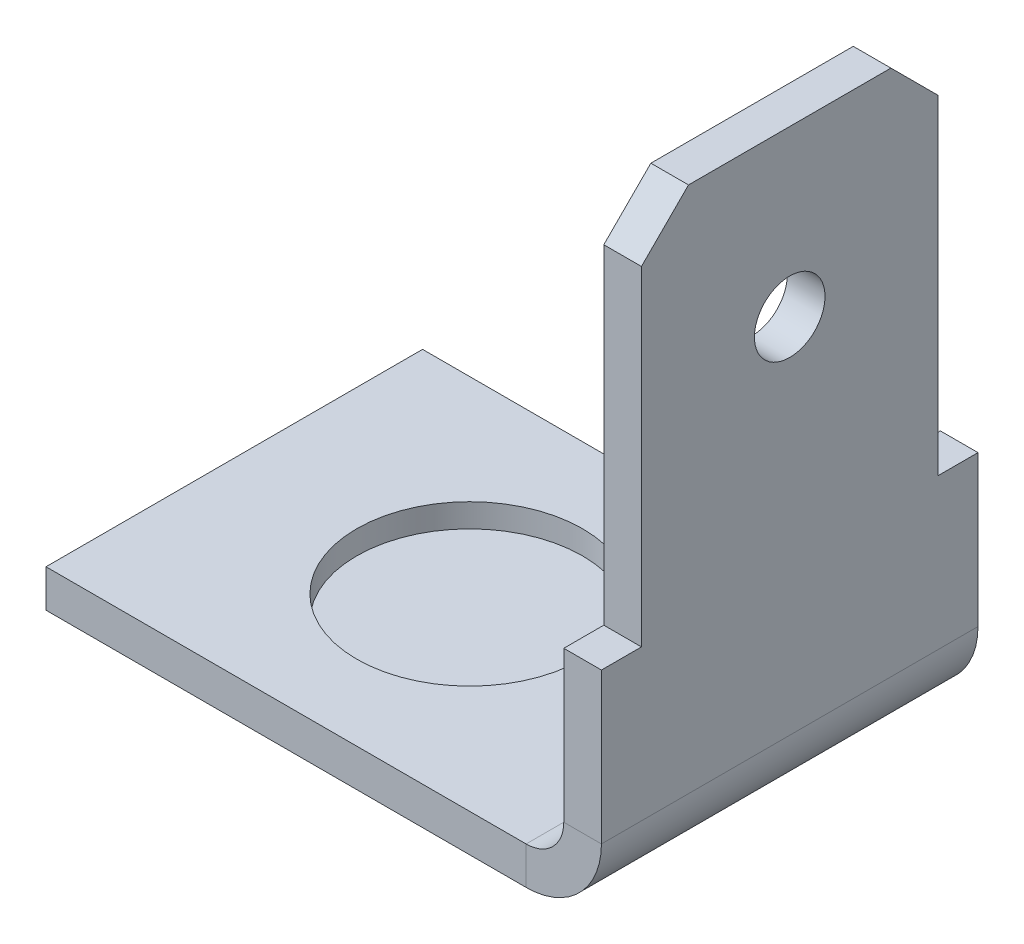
ISO-10303-21;
HEADER;
FILE_DESCRIPTION(('STEP AP214'),'2;1');
FILE_NAME('part.step','',(''),(''),'','','');
FILE_SCHEMA(('AUTOMOTIVE_DESIGN { 1 0 10303 214 1 1 1 1 }'));
ENDSEC;
DATA;
#1=APPLICATION_CONTEXT('core data for automotive mechanical design processes');
#2=APPLICATION_PROTOCOL_DEFINITION('international standard','automotive_design',2000,#1);
#3=PRODUCT_CONTEXT('',#1,'mechanical');
#4=PRODUCT('Part','Part','',(#3));
#5=PRODUCT_RELATED_PRODUCT_CATEGORY('part','',(#4));
#6=PRODUCT_DEFINITION_FORMATION('','',#4);
#7=PRODUCT_DEFINITION_CONTEXT('part definition',#1,'design');
#8=PRODUCT_DEFINITION('design','',#6,#7);
#9=PRODUCT_DEFINITION_SHAPE('','',#8);
#10=(LENGTH_UNIT() NAMED_UNIT(*) SI_UNIT(.MILLI.,.METRE.));
#11=(NAMED_UNIT(*) PLANE_ANGLE_UNIT() SI_UNIT($,.RADIAN.));
#12=(NAMED_UNIT(*) SI_UNIT($,.STERADIAN.) SOLID_ANGLE_UNIT());
#13=UNCERTAINTY_MEASURE_WITH_UNIT(LENGTH_MEASURE(1.E-05),#10,'distance_accuracy_value','');
#14=(GEOMETRIC_REPRESENTATION_CONTEXT(3) GLOBAL_UNCERTAINTY_ASSIGNED_CONTEXT((#13)) GLOBAL_UNIT_ASSIGNED_CONTEXT((#10,
#11,#12)) REPRESENTATION_CONTEXT('',''));
#15=CARTESIAN_POINT('',(0.,0.,0.));
#16=DIRECTION('',(0.,0.,1.));
#17=DIRECTION('',(1.,0.,0.));
#18=AXIS2_PLACEMENT_3D('',#15,#16,#17);
#19=CARTESIAN_POINT('',(0.,-0.8,4.));
#20=DIRECTION('',(0.,1.,0.));
#21=DIRECTION('',(0.,0.,1.));
#22=AXIS2_PLACEMENT_3D('',#19,#20,#21);
#23=PLANE('',#22);
#24=DIRECTION('',(0.,0.,-1.));
#25=VECTOR('',#24,1.);
#26=CARTESIAN_POINT('',(0.,-0.8,4.));
#27=LINE('',#26,#25);
#28=CARTESIAN_POINT('',(0.,-0.8,4.));
#29=VERTEX_POINT('',#28);
#30=CARTESIAN_POINT('',(0.,-0.8,-4.));
#31=VERTEX_POINT('',#30);
#32=EDGE_CURVE('E232',#29,#31,#27,.T.);
#33=ORIENTED_EDGE('',*,*,#32,.T.);
#34=DIRECTION('',(1.,0.,0.));
#35=VECTOR('',#34,1.);
#36=CARTESIAN_POINT('',(0.,-0.8,-4.));
#37=LINE('',#36,#35);
#38=CARTESIAN_POINT('',(10.2,-0.8,-4.));
#39=VERTEX_POINT('',#38);
#40=EDGE_CURVE('E199',#31,#39,#37,.T.);
#41=ORIENTED_EDGE('',*,*,#40,.T.);
#42=DIRECTION('',(0.,0.,-1.));
#43=VECTOR('',#42,1.);
#44=CARTESIAN_POINT('',(10.2,-0.8,4.));
#45=LINE('',#44,#43);
#46=CARTESIAN_POINT('',(10.2,-0.8,4.));
#47=VERTEX_POINT('',#46);
#48=EDGE_CURVE('E229',#47,#39,#45,.T.);
#49=ORIENTED_EDGE('',*,*,#48,.F.);
#50=DIRECTION('',(1.,0.,0.));
#51=VECTOR('',#50,1.);
#52=CARTESIAN_POINT('',(0.,-0.8,4.));
#53=LINE('',#52,#51);
#54=EDGE_CURVE('E220',#29,#47,#53,.T.);
#55=ORIENTED_EDGE('',*,*,#54,.F.);
#56=EDGE_LOOP('',(#33,#41,#49,#55));
#57=FACE_BOUND('',#56,.T.);
#58=CARTESIAN_POINT('',(5.,-0.8,0.));
#59=DIRECTION('',(0.,1.,0.));
#60=DIRECTION('',(0.,0.,1.));
#61=AXIS2_PLACEMENT_3D('',#58,#59,#60);
#62=CIRCLE('',#61,0.500000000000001);
#63=CARTESIAN_POINT('',(5.,-0.8,0.500000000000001));
#64=VERTEX_POINT('',#63);
#65=EDGE_CURVE('E11',#64,#64,#62,.F.);
#66=ORIENTED_EDGE('',*,*,#65,.F.);
#67=EDGE_LOOP('',(#66));
#68=FACE_BOUND('',#67,.T.);
#69=ADVANCED_FACE('F34',(#57,#68),#23,.F.);
#70=CARTESIAN_POINT('',(11.,0.800000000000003,4.));
#71=DIRECTION('',(0.,0.,1.));
#72=DIRECTION('',(1.,0.,0.));
#73=AXIS2_PLACEMENT_3D('',#70,#71,#72);
#74=PLANE('',#73);
#75=DIRECTION('',(1.,0.,0.));
#76=VECTOR('',#75,1.);
#77=CARTESIAN_POINT('',(11.,0.800000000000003,4.));
#78=LINE('',#77,#76);
#79=CARTESIAN_POINT('',(11.,0.800000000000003,4.));
#80=VERTEX_POINT('',#79);
#81=CARTESIAN_POINT('',(11.8,0.800000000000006,4.));
#82=VERTEX_POINT('',#81);
#83=EDGE_CURVE('E253',#80,#82,#78,.T.);
#84=ORIENTED_EDGE('',*,*,#83,.F.);
#85=CARTESIAN_POINT('',(10.2,0.8,4.));
#86=DIRECTION('',(0.,0.,-1.));
#87=DIRECTION('',(-1.,0.,0.));
#88=AXIS2_PLACEMENT_3D('',#85,#86,#87);
#89=CIRCLE('',#88,0.8);
#90=CARTESIAN_POINT('',(10.2,0.,4.));
#91=VERTEX_POINT('',#90);
#92=EDGE_CURVE('E211',#91,#80,#89,.F.);
#93=ORIENTED_EDGE('',*,*,#92,.F.);
#94=DIRECTION('',(0.,1.,0.));
#95=VECTOR('',#94,1.);
#96=CARTESIAN_POINT('',(10.2,-0.8,4.));
#97=LINE('',#96,#95);
#98=EDGE_CURVE('E251',#47,#91,#97,.T.);
#99=ORIENTED_EDGE('',*,*,#98,.F.);
#100=CARTESIAN_POINT('',(10.2,0.8,4.));
#101=DIRECTION('',(0.,0.,1.));
#102=DIRECTION('',(1.,0.,0.));
#103=AXIS2_PLACEMENT_3D('',#100,#101,#102);
#104=CIRCLE('',#103,1.6);
#105=EDGE_CURVE('E223',#47,#82,#104,.T.);
#106=ORIENTED_EDGE('',*,*,#105,.T.);
#107=EDGE_LOOP('',(#84,#93,#99,#106));
#108=FACE_BOUND('',#107,.T.);
#109=ADVANCED_FACE('F302',(#108),#74,.T.);
#110=CARTESIAN_POINT('',(10.2,-0.8,4.));
#111=DIRECTION('',(0.,0.,1.));
#112=DIRECTION('',(1.,0.,0.));
#113=AXIS2_PLACEMENT_3D('',#110,#111,#112);
#114=PLANE('',#113);
#115=DIRECTION('',(-1.,0.,0.));
#116=VECTOR('',#115,1.);
#117=CARTESIAN_POINT('',(21.,4.00000000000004,4.));
#118=LINE('',#117,#116);
#119=CARTESIAN_POINT('',(11.8,4.,4.));
#120=VERTEX_POINT('',#119);
#121=CARTESIAN_POINT('',(11.,4.,4.));
#122=VERTEX_POINT('',#121);
#123=EDGE_CURVE('E175',#120,#122,#118,.T.);
#124=ORIENTED_EDGE('',*,*,#123,.T.);
#125=DIRECTION('',(0.,1.,0.));
#126=VECTOR('',#125,1.);
#127=CARTESIAN_POINT('',(11.,0.,4.));
#128=LINE('',#127,#126);
#129=EDGE_CURVE('E208',#80,#122,#128,.T.);
#130=ORIENTED_EDGE('',*,*,#129,.F.);
#131=ORIENTED_EDGE('',*,*,#83,.T.);
#132=DIRECTION('',(0.,1.,0.));
#133=VECTOR('',#132,1.);
#134=CARTESIAN_POINT('',(11.8,0.,4.));
#135=LINE('',#134,#133);
#136=EDGE_CURVE('E205',#82,#120,#135,.T.);
#137=ORIENTED_EDGE('',*,*,#136,.T.);
#138=EDGE_LOOP('',(#124,#130,#131,#137));
#139=FACE_BOUND('',#138,.T.);
#140=ADVANCED_FACE('F282',(#139),#114,.T.);
#141=CARTESIAN_POINT('',(10.2,0.,-4.));
#142=DIRECTION('',(0.,0.,-1.));
#143=DIRECTION('',(-1.,0.,0.));
#144=AXIS2_PLACEMENT_3D('',#141,#142,#143);
#145=PLANE('',#144);
#146=DIRECTION('',(0.,-1.,0.));
#147=VECTOR('',#146,1.);
#148=CARTESIAN_POINT('',(10.2,0.,-4.));
#149=LINE('',#148,#147);
#150=CARTESIAN_POINT('',(10.2,0.,-4.));
#151=VERTEX_POINT('',#150);
#152=EDGE_CURVE('E249',#151,#39,#149,.T.);
#153=ORIENTED_EDGE('',*,*,#152,.F.);
#154=CARTESIAN_POINT('',(10.2,0.8,-4.));
#155=DIRECTION('',(0.,0.,-1.));
#156=DIRECTION('',(-1.,0.,0.));
#157=AXIS2_PLACEMENT_3D('',#154,#155,#156);
#158=CIRCLE('',#157,0.8);
#159=CARTESIAN_POINT('',(11.,0.800000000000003,-4.));
#160=VERTEX_POINT('',#159);
#161=EDGE_CURVE('E190',#151,#160,#158,.F.);
#162=ORIENTED_EDGE('',*,*,#161,.T.);
#163=DIRECTION('',(-1.,0.,0.));
#164=VECTOR('',#163,1.);
#165=CARTESIAN_POINT('',(11.8,0.800000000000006,-4.));
#166=LINE('',#165,#164);
#167=CARTESIAN_POINT('',(11.8,0.800000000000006,-4.));
#168=VERTEX_POINT('',#167);
#169=EDGE_CURVE('E247',#168,#160,#166,.T.);
#170=ORIENTED_EDGE('',*,*,#169,.F.);
#171=CARTESIAN_POINT('',(10.2,0.8,-4.));
#172=DIRECTION('',(0.,0.,1.));
#173=DIRECTION('',(1.,0.,0.));
#174=AXIS2_PLACEMENT_3D('',#171,#172,#173);
#175=CIRCLE('',#174,1.6);
#176=EDGE_CURVE('E202',#39,#168,#175,.T.);
#177=ORIENTED_EDGE('',*,*,#176,.F.);
#178=EDGE_LOOP('',(#153,#162,#170,#177));
#179=FACE_BOUND('',#178,.T.);
#180=ADVANCED_FACE('F295',(#179),#145,.T.);
#181=CARTESIAN_POINT('',(11.8,0.800000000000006,-4.));
#182=DIRECTION('',(0.,0.,-1.));
#183=DIRECTION('',(-1.,0.,0.));
#184=AXIS2_PLACEMENT_3D('',#181,#182,#183);
#185=PLANE('',#184);
#186=DIRECTION('',(1.,0.,0.));
#187=VECTOR('',#186,1.);
#188=CARTESIAN_POINT('',(0.,0.,-4.));
#189=LINE('',#188,#187);
#190=CARTESIAN_POINT('',(0.,0.,-4.));
#191=VERTEX_POINT('',#190);
#192=EDGE_CURVE('E193',#191,#151,#189,.T.);
#193=ORIENTED_EDGE('',*,*,#192,.T.);
#194=ORIENTED_EDGE('',*,*,#152,.T.);
#195=ORIENTED_EDGE('',*,*,#40,.F.);
#196=DIRECTION('',(0.,1.,0.));
#197=VECTOR('',#196,1.);
#198=CARTESIAN_POINT('',(0.,-0.8,-4.));
#199=LINE('',#198,#197);
#200=EDGE_CURVE('E196',#31,#191,#199,.T.);
#201=ORIENTED_EDGE('',*,*,#200,.T.);
#202=EDGE_LOOP('',(#193,#194,#195,#201));
#203=FACE_BOUND('',#202,.T.);
#204=ADVANCED_FACE('F318',(#203),#185,.T.);
#205=CARTESIAN_POINT('',(11.8,0.,4.));
#206=DIRECTION('',(-1.,0.,0.));
#207=DIRECTION('',(0.,-1.,0.));
#208=AXIS2_PLACEMENT_3D('',#205,#206,#207);
#209=PLANE('',#208);
#210=CARTESIAN_POINT('',(11.8,8.5,0.));
#211=DIRECTION('',(-1.,0.,0.));
#212=DIRECTION('',(0.,-1.,0.));
#213=AXIS2_PLACEMENT_3D('',#210,#211,#212);
#214=CIRCLE('',#213,0.75);
#215=CARTESIAN_POINT('',(11.8,7.75,0.));
#216=VERTEX_POINT('',#215);
#217=EDGE_CURVE('E167',#216,#216,#214,.T.);
#218=ORIENTED_EDGE('',*,*,#217,.T.);
#219=EDGE_LOOP('',(#218));
#220=FACE_BOUND('',#219,.T.);
#221=DIRECTION('',(0.,1.,0.));
#222=VECTOR('',#221,1.);
#223=CARTESIAN_POINT('',(11.8,0.,-3.15));
#224=LINE('',#223,#222);
#225=CARTESIAN_POINT('',(11.8,4.,-3.15));
#226=VERTEX_POINT('',#225);
#227=CARTESIAN_POINT('',(11.8,11.,-3.15));
#228=VERTEX_POINT('',#227);
#229=EDGE_CURVE('E140',#226,#228,#224,.T.);
#230=ORIENTED_EDGE('',*,*,#229,.T.);
#231=DIRECTION('',(0.,0.707106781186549,0.707106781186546));
#232=VECTOR('',#231,1.);
#233=CARTESIAN_POINT('',(11.8,12.,-2.15));
#234=LINE('',#233,#232);
#235=CARTESIAN_POINT('',(11.8,12.,-2.15));
#236=VERTEX_POINT('',#235);
#237=EDGE_CURVE('E266',#228,#236,#234,.T.);
#238=ORIENTED_EDGE('',*,*,#237,.T.);
#239=DIRECTION('',(0.,0.,-1.));
#240=VECTOR('',#239,1.);
#241=CARTESIAN_POINT('',(11.8,12.,4.));
#242=LINE('',#241,#240);
#243=CARTESIAN_POINT('',(11.8,12.,2.15));
#244=VERTEX_POINT('',#243);
#245=EDGE_CURVE('E244',#244,#236,#242,.T.);
#246=ORIENTED_EDGE('',*,*,#245,.F.);
#247=DIRECTION('',(0.,-0.707106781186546,0.707106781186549));
#248=VECTOR('',#247,1.);
#249=CARTESIAN_POINT('',(11.8,11.,3.15));
#250=LINE('',#249,#248);
#251=CARTESIAN_POINT('',(11.8,11.,3.15));
#252=VERTEX_POINT('',#251);
#253=EDGE_CURVE('E49',#244,#252,#250,.T.);
#254=ORIENTED_EDGE('',*,*,#253,.T.);
#255=DIRECTION('',(0.,-1.,0.));
#256=VECTOR('',#255,1.);
#257=CARTESIAN_POINT('',(11.8,0.,3.15));
#258=LINE('',#257,#256);
#259=CARTESIAN_POINT('',(11.8,4.,3.15));
#260=VERTEX_POINT('',#259);
#261=EDGE_CURVE('E178',#252,#260,#258,.T.);
#262=ORIENTED_EDGE('',*,*,#261,.T.);
#263=DIRECTION('',(0.,0.,1.));
#264=VECTOR('',#263,1.);
#265=CARTESIAN_POINT('',(11.8,4.,4.));
#266=LINE('',#265,#264);
#267=EDGE_CURVE('E182',#260,#120,#266,.T.);
#268=ORIENTED_EDGE('',*,*,#267,.T.);
#269=ORIENTED_EDGE('',*,*,#136,.F.);
#270=DIRECTION('',(0.,0.,-1.));
#271=VECTOR('',#270,1.);
#272=CARTESIAN_POINT('',(11.8,0.800000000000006,4.));
#273=LINE('',#272,#271);
#274=EDGE_CURVE('E226',#82,#168,#273,.T.);
#275=ORIENTED_EDGE('',*,*,#274,.T.);
#276=DIRECTION('',(0.,1.,0.));
#277=VECTOR('',#276,1.);
#278=CARTESIAN_POINT('',(11.8,0.,-4.));
#279=LINE('',#278,#277);
#280=CARTESIAN_POINT('',(11.8,4.,-4.));
#281=VERTEX_POINT('',#280);
#282=EDGE_CURVE('E185',#168,#281,#279,.T.);
#283=ORIENTED_EDGE('',*,*,#282,.T.);
#284=DIRECTION('',(0.,0.,1.));
#285=VECTOR('',#284,1.);
#286=CARTESIAN_POINT('',(11.8,4.,4.));
#287=LINE('',#286,#285);
#288=EDGE_CURVE('E143',#281,#226,#287,.T.);
#289=ORIENTED_EDGE('',*,*,#288,.T.);
#290=EDGE_LOOP('',(#230,#238,#246,#254,#262,#268,#269,#275,#283,#289));
#291=FACE_BOUND('',#290,.T.);
#292=ADVANCED_FACE('F284',(#220,#291),#209,.F.);
#293=CARTESIAN_POINT('',(11.,12.,4.));
#294=DIRECTION('',(0.,1.,0.));
#295=DIRECTION('',(-1.,0.,0.));
#296=AXIS2_PLACEMENT_3D('',#293,#294,#295);
#297=PLANE('',#296);
#298=ORIENTED_EDGE('',*,*,#245,.T.);
#299=DIRECTION('',(-1.,0.,0.));
#300=VECTOR('',#299,1.);
#301=CARTESIAN_POINT('',(11.,12.,-2.15));
#302=LINE('',#301,#300);
#303=CARTESIAN_POINT('',(11.,12.,-2.15));
#304=VERTEX_POINT('',#303);
#305=EDGE_CURVE('E258',#236,#304,#302,.T.);
#306=ORIENTED_EDGE('',*,*,#305,.T.);
#307=DIRECTION('',(0.,0.,-1.));
#308=VECTOR('',#307,1.);
#309=CARTESIAN_POINT('',(11.,12.,4.));
#310=LINE('',#309,#308);
#311=CARTESIAN_POINT('',(11.,12.,2.15));
#312=VERTEX_POINT('',#311);
#313=EDGE_CURVE('E242',#312,#304,#310,.T.);
#314=ORIENTED_EDGE('',*,*,#313,.F.);
#315=DIRECTION('',(1.,0.,0.));
#316=VECTOR('',#315,1.);
#317=CARTESIAN_POINT('',(11.8,12.,2.15));
#318=LINE('',#317,#316);
#319=EDGE_CURVE('E256',#312,#244,#318,.T.);
#320=ORIENTED_EDGE('',*,*,#319,.T.);
#321=EDGE_LOOP('',(#298,#306,#314,#320));
#322=FACE_BOUND('',#321,.T.);
#323=ADVANCED_FACE('F325',(#322),#297,.T.);
#324=CARTESIAN_POINT('',(11.,0.,4.));
#325=DIRECTION('',(-1.,0.,0.));
#326=DIRECTION('',(0.,-1.,0.));
#327=AXIS2_PLACEMENT_3D('',#324,#325,#326);
#328=PLANE('',#327);
#329=ORIENTED_EDGE('',*,*,#313,.T.);
#330=DIRECTION('',(0.,-0.707106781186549,-0.707106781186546));
#331=VECTOR('',#330,1.);
#332=CARTESIAN_POINT('',(11.,9.07499999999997,-5.07500000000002));
#333=LINE('',#332,#331);
#334=CARTESIAN_POINT('',(11.,11.,-3.15));
#335=VERTEX_POINT('',#334);
#336=EDGE_CURVE('E158',#304,#335,#333,.T.);
#337=ORIENTED_EDGE('',*,*,#336,.T.);
#338=DIRECTION('',(0.,1.,0.));
#339=VECTOR('',#338,1.);
#340=CARTESIAN_POINT('',(11.,12.,-3.15));
#341=LINE('',#340,#339);
#342=CARTESIAN_POINT('',(11.,4.,-3.15));
#343=VERTEX_POINT('',#342);
#344=EDGE_CURVE('E139',#343,#335,#341,.T.);
#345=ORIENTED_EDGE('',*,*,#344,.F.);
#346=DIRECTION('',(0.,0.,1.));
#347=VECTOR('',#346,1.);
#348=CARTESIAN_POINT('',(11.,4.,-3.15));
#349=LINE('',#348,#347);
#350=CARTESIAN_POINT('',(11.,4.,-4.));
#351=VERTEX_POINT('',#350);
#352=EDGE_CURVE('E146',#351,#343,#349,.T.);
#353=ORIENTED_EDGE('',*,*,#352,.F.);
#354=DIRECTION('',(0.,1.,0.));
#355=VECTOR('',#354,1.);
#356=CARTESIAN_POINT('',(11.,0.,-4.));
#357=LINE('',#356,#355);
#358=EDGE_CURVE('E188',#160,#351,#357,.T.);
#359=ORIENTED_EDGE('',*,*,#358,.F.);
#360=DIRECTION('',(0.,0.,-1.));
#361=VECTOR('',#360,1.);
#362=CARTESIAN_POINT('',(11.,0.800000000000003,4.));
#363=LINE('',#362,#361);
#364=EDGE_CURVE('E239',#80,#160,#363,.T.);
#365=ORIENTED_EDGE('',*,*,#364,.F.);
#366=ORIENTED_EDGE('',*,*,#129,.T.);
#367=DIRECTION('',(0.,0.,1.));
#368=VECTOR('',#367,1.);
#369=CARTESIAN_POINT('',(11.,4.,3.15));
#370=LINE('',#369,#368);
#371=CARTESIAN_POINT('',(11.,4.,3.15));
#372=VERTEX_POINT('',#371);
#373=EDGE_CURVE('E172',#372,#122,#370,.T.);
#374=ORIENTED_EDGE('',*,*,#373,.F.);
#375=DIRECTION('',(0.,-1.,0.));
#376=VECTOR('',#375,1.);
#377=CARTESIAN_POINT('',(11.,12.,3.15));
#378=LINE('',#377,#376);
#379=CARTESIAN_POINT('',(11.,11.,3.15));
#380=VERTEX_POINT('',#379);
#381=EDGE_CURVE('E170',#380,#372,#378,.T.);
#382=ORIENTED_EDGE('',*,*,#381,.F.);
#383=DIRECTION('',(0.,0.707106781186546,-0.707106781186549));
#384=VECTOR('',#383,1.);
#385=CARTESIAN_POINT('',(11.,5.07500000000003,9.075));
#386=LINE('',#385,#384);
#387=EDGE_CURVE('E261',#380,#312,#386,.T.);
#388=ORIENTED_EDGE('',*,*,#387,.T.);
#389=EDGE_LOOP('',(#329,#337,#345,#353,#359,#365,#366,#374,#382,#388));
#390=FACE_BOUND('',#389,.T.);
#391=CARTESIAN_POINT('',(11.,8.5,0.));
#392=DIRECTION('',(-1.,0.,0.));
#393=DIRECTION('',(0.,-1.,0.));
#394=AXIS2_PLACEMENT_3D('',#391,#392,#393);
#395=CIRCLE('',#394,0.75);
#396=CARTESIAN_POINT('',(11.,7.75,0.));
#397=VERTEX_POINT('',#396);
#398=EDGE_CURVE('E164',#397,#397,#395,.T.);
#399=ORIENTED_EDGE('',*,*,#398,.F.);
#400=EDGE_LOOP('',(#399));
#401=FACE_BOUND('',#400,.T.);
#402=ADVANCED_FACE('F156',(#390,#401),#328,.T.);
#403=CARTESIAN_POINT('',(10.2,0.8,4.));
#404=DIRECTION('',(0.,0.,-1.));
#405=DIRECTION('',(-1.,0.,0.));
#406=AXIS2_PLACEMENT_3D('',#403,#404,#405);
#407=CYLINDRICAL_SURFACE('',#406,0.8);
#408=ORIENTED_EDGE('',*,*,#364,.T.);
#409=ORIENTED_EDGE('',*,*,#161,.F.);
#410=DIRECTION('',(0.,0.,-1.));
#411=VECTOR('',#410,1.);
#412=CARTESIAN_POINT('',(10.2,0.,4.));
#413=LINE('',#412,#411);
#414=EDGE_CURVE('E236',#91,#151,#413,.T.);
#415=ORIENTED_EDGE('',*,*,#414,.F.);
#416=ORIENTED_EDGE('',*,*,#92,.T.);
#417=EDGE_LOOP('',(#408,#409,#415,#416));
#418=FACE_BOUND('',#417,.T.);
#419=ADVANCED_FACE('F299',(#418),#407,.F.);
#420=CARTESIAN_POINT('',(0.,0.,4.));
#421=DIRECTION('',(0.,1.,0.));
#422=DIRECTION('',(0.,0.,1.));
#423=AXIS2_PLACEMENT_3D('',#420,#421,#422);
#424=PLANE('',#423);
#425=CARTESIAN_POINT('',(5.,0.,0.));
#426=DIRECTION('',(0.,1.,0.));
#427=DIRECTION('',(0.,0.,1.));
#428=AXIS2_PLACEMENT_3D('',#425,#426,#427);
#429=CIRCLE('',#428,2.4);
#430=CARTESIAN_POINT('',(5.,0.,2.4));
#431=VERTEX_POINT('',#430);
#432=EDGE_CURVE('E574',#431,#431,#429,.T.);
#433=ORIENTED_EDGE('',*,*,#432,.F.);
#434=EDGE_LOOP('',(#433));
#435=FACE_BOUND('',#434,.T.);
#436=ORIENTED_EDGE('',*,*,#414,.T.);
#437=ORIENTED_EDGE('',*,*,#192,.F.);
#438=DIRECTION('',(0.,0.,-1.));
#439=VECTOR('',#438,1.);
#440=CARTESIAN_POINT('',(0.,0.,4.));
#441=LINE('',#440,#439);
#442=CARTESIAN_POINT('',(0.,0.,4.));
#443=VERTEX_POINT('',#442);
#444=EDGE_CURVE('E234',#443,#191,#441,.T.);
#445=ORIENTED_EDGE('',*,*,#444,.F.);
#446=DIRECTION('',(1.,0.,0.));
#447=VECTOR('',#446,1.);
#448=CARTESIAN_POINT('',(0.,0.,4.));
#449=LINE('',#448,#447);
#450=EDGE_CURVE('E214',#443,#91,#449,.T.);
#451=ORIENTED_EDGE('',*,*,#450,.T.);
#452=EDGE_LOOP('',(#436,#437,#445,#451));
#453=FACE_BOUND('',#452,.T.);
#454=ADVANCED_FACE('F305',(#435,#453),#424,.T.);
#455=CARTESIAN_POINT('',(0.,-0.8,4.));
#456=DIRECTION('',(-1.,0.,0.));
#457=DIRECTION('',(0.,0.,1.));
#458=AXIS2_PLACEMENT_3D('',#455,#456,#457);
#459=PLANE('',#458);
#460=ORIENTED_EDGE('',*,*,#444,.T.);
#461=ORIENTED_EDGE('',*,*,#200,.F.);
#462=ORIENTED_EDGE('',*,*,#32,.F.);
#463=DIRECTION('',(0.,1.,0.));
#464=VECTOR('',#463,1.);
#465=CARTESIAN_POINT('',(0.,-0.8,4.));
#466=LINE('',#465,#464);
#467=EDGE_CURVE('E217',#29,#443,#466,.T.);
#468=ORIENTED_EDGE('',*,*,#467,.T.);
#469=EDGE_LOOP('',(#460,#461,#462,#468));
#470=FACE_BOUND('',#469,.T.);
#471=ADVANCED_FACE('F311',(#470),#459,.T.);
#472=CARTESIAN_POINT('',(10.2,0.8,4.));
#473=DIRECTION('',(0.,0.,-1.));
#474=DIRECTION('',(-1.,0.,0.));
#475=AXIS2_PLACEMENT_3D('',#472,#473,#474);
#476=CYLINDRICAL_SURFACE('',#475,1.6);
#477=ORIENTED_EDGE('',*,*,#48,.T.);
#478=ORIENTED_EDGE('',*,*,#176,.T.);
#479=ORIENTED_EDGE('',*,*,#274,.F.);
#480=ORIENTED_EDGE('',*,*,#105,.F.);
#481=EDGE_LOOP('',(#477,#478,#479,#480));
#482=FACE_BOUND('',#481,.T.);
#483=ADVANCED_FACE('F292',(#482),#476,.T.);
#484=CARTESIAN_POINT('',(10.2,0.8,4.));
#485=DIRECTION('',(0.,0.,-1.));
#486=DIRECTION('',(-1.,0.,0.));
#487=AXIS2_PLACEMENT_3D('',#484,#485,#486);
#488=PLANE('',#487);
#489=ORIENTED_EDGE('',*,*,#54,.T.);
#490=ORIENTED_EDGE('',*,*,#98,.T.);
#491=ORIENTED_EDGE('',*,*,#450,.F.);
#492=ORIENTED_EDGE('',*,*,#467,.F.);
#493=EDGE_LOOP('',(#489,#490,#491,#492));
#494=FACE_BOUND('',#493,.T.);
#495=ADVANCED_FACE('F309',(#494),#488,.F.);
#496=CARTESIAN_POINT('',(10.2,0.8,-4.));
#497=DIRECTION('',(0.,0.,-1.));
#498=DIRECTION('',(-1.,0.,0.));
#499=AXIS2_PLACEMENT_3D('',#496,#497,#498);
#500=PLANE('',#499);
#501=DIRECTION('',(-1.,0.,0.));
#502=VECTOR('',#501,1.);
#503=CARTESIAN_POINT('',(10.2,4.,-4.));
#504=LINE('',#503,#502);
#505=EDGE_CURVE('E149',#281,#351,#504,.T.);
#506=ORIENTED_EDGE('',*,*,#505,.F.);
#507=ORIENTED_EDGE('',*,*,#282,.F.);
#508=ORIENTED_EDGE('',*,*,#169,.T.);
#509=ORIENTED_EDGE('',*,*,#358,.T.);
#510=EDGE_LOOP('',(#506,#507,#508,#509));
#511=FACE_BOUND('',#510,.T.);
#512=ADVANCED_FACE('F290',(#511),#500,.T.);
#513=CARTESIAN_POINT('',(21.,4.00000000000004,3.15));
#514=DIRECTION('',(0.,-1.,0.));
#515=DIRECTION('',(1.,0.,0.));
#516=AXIS2_PLACEMENT_3D('',#513,#514,#515);
#517=PLANE('',#516);
#518=DIRECTION('',(-1.,0.,0.));
#519=VECTOR('',#518,1.);
#520=CARTESIAN_POINT('',(21.,4.00000000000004,3.15));
#521=LINE('',#520,#519);
#522=EDGE_CURVE('E174',#260,#372,#521,.T.);
#523=ORIENTED_EDGE('',*,*,#522,.T.);
#524=ORIENTED_EDGE('',*,*,#373,.T.);
#525=ORIENTED_EDGE('',*,*,#123,.F.);
#526=ORIENTED_EDGE('',*,*,#267,.F.);
#527=EDGE_LOOP('',(#523,#524,#525,#526));
#528=FACE_BOUND('',#527,.T.);
#529=ADVANCED_FACE('F279',(#528),#517,.F.);
#530=CARTESIAN_POINT('',(21.,12.,3.15));
#531=DIRECTION('',(0.,0.,-1.));
#532=DIRECTION('',(-1.,0.,0.));
#533=AXIS2_PLACEMENT_3D('',#530,#531,#532);
#534=PLANE('',#533);
#535=ORIENTED_EDGE('',*,*,#261,.F.);
#536=DIRECTION('',(-1.,0.,0.));
#537=VECTOR('',#536,1.);
#538=CARTESIAN_POINT('',(11.,11.,3.15));
#539=LINE('',#538,#537);
#540=EDGE_CURVE('E42',#252,#380,#539,.T.);
#541=ORIENTED_EDGE('',*,*,#540,.T.);
#542=ORIENTED_EDGE('',*,*,#381,.T.);
#543=ORIENTED_EDGE('',*,*,#522,.F.);
#544=EDGE_LOOP('',(#535,#541,#542,#543));
#545=FACE_BOUND('',#544,.T.);
#546=ADVANCED_FACE('F271',(#545),#534,.F.);
#547=CARTESIAN_POINT('',(21.,8.50000000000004,0.));
#548=DIRECTION('',(-1.,0.,0.));
#549=DIRECTION('',(0.,-1.,0.));
#550=AXIS2_PLACEMENT_3D('',#547,#548,#549);
#551=CYLINDRICAL_SURFACE('',#550,0.75);
#552=ORIENTED_EDGE('',*,*,#398,.T.);
#553=EDGE_LOOP('',(#552));
#554=FACE_BOUND('',#553,.T.);
#555=ORIENTED_EDGE('',*,*,#217,.F.);
#556=EDGE_LOOP('',(#555));
#557=FACE_BOUND('',#556,.T.);
#558=ADVANCED_FACE('F435',(#554,#557),#551,.F.);
#559=CARTESIAN_POINT('',(21.,12.,-3.15));
#560=DIRECTION('',(0.,0.,1.));
#561=DIRECTION('',(1.,0.,0.));
#562=AXIS2_PLACEMENT_3D('',#559,#560,#561);
#563=PLANE('',#562);
#564=ORIENTED_EDGE('',*,*,#344,.T.);
#565=DIRECTION('',(1.,0.,0.));
#566=VECTOR('',#565,1.);
#567=CARTESIAN_POINT('',(11.8,11.,-3.15));
#568=LINE('',#567,#566);
#569=EDGE_CURVE('E57',#335,#228,#568,.T.);
#570=ORIENTED_EDGE('',*,*,#569,.T.);
#571=ORIENTED_EDGE('',*,*,#229,.F.);
#572=DIRECTION('',(-1.,0.,0.));
#573=VECTOR('',#572,1.);
#574=CARTESIAN_POINT('',(21.,4.00000000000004,-3.15));
#575=LINE('',#574,#573);
#576=EDGE_CURVE('E135',#226,#343,#575,.T.);
#577=ORIENTED_EDGE('',*,*,#576,.T.);
#578=EDGE_LOOP('',(#564,#570,#571,#577));
#579=FACE_BOUND('',#578,.T.);
#580=ADVANCED_FACE('F137',(#579),#563,.F.);
#581=CARTESIAN_POINT('',(21.,4.00000000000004,-3.15));
#582=DIRECTION('',(0.,-1.,0.));
#583=DIRECTION('',(1.,0.,0.));
#584=AXIS2_PLACEMENT_3D('',#581,#582,#583);
#585=PLANE('',#584);
#586=ORIENTED_EDGE('',*,*,#505,.T.);
#587=ORIENTED_EDGE('',*,*,#352,.T.);
#588=ORIENTED_EDGE('',*,*,#576,.F.);
#589=ORIENTED_EDGE('',*,*,#288,.F.);
#590=EDGE_LOOP('',(#586,#587,#588,#589));
#591=FACE_BOUND('',#590,.T.);
#592=ADVANCED_FACE('F147',(#591),#585,.F.);
#593=CARTESIAN_POINT('',(11.,12.,-2.15));
#594=DIRECTION('',(0.,0.707106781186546,-0.707106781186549));
#595=DIRECTION('',(0.,0.707106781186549,0.707106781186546));
#596=AXIS2_PLACEMENT_3D('',#593,#594,#595);
#597=PLANE('',#596);
#598=ORIENTED_EDGE('',*,*,#237,.F.);
#599=ORIENTED_EDGE('',*,*,#569,.F.);
#600=ORIENTED_EDGE('',*,*,#336,.F.);
#601=ORIENTED_EDGE('',*,*,#305,.F.);
#602=EDGE_LOOP('',(#598,#599,#600,#601));
#603=FACE_BOUND('',#602,.T.);
#604=ADVANCED_FACE('F355',(#603),#597,.T.);
#605=CARTESIAN_POINT('',(21.,11.,3.15));
#606=DIRECTION('',(0.,0.707106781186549,0.707106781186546));
#607=DIRECTION('',(0.,-0.707106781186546,0.707106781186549));
#608=AXIS2_PLACEMENT_3D('',#605,#606,#607);
#609=PLANE('',#608);
#610=ORIENTED_EDGE('',*,*,#253,.F.);
#611=ORIENTED_EDGE('',*,*,#319,.F.);
#612=ORIENTED_EDGE('',*,*,#387,.F.);
#613=ORIENTED_EDGE('',*,*,#540,.F.);
#614=EDGE_LOOP('',(#610,#611,#612,#613));
#615=FACE_BOUND('',#614,.T.);
#616=ADVANCED_FACE('F36',(#615),#609,.T.);
#617=CARTESIAN_POINT('',(5.,-1.3,0.));
#618=DIRECTION('',(0.,1.,0.));
#619=DIRECTION('',(0.,0.,1.));
#620=AXIS2_PLACEMENT_3D('',#617,#618,#619);
#621=CYLINDRICAL_SURFACE('',#620,0.500000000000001);
#622=CARTESIAN_POINT('',(5.,-1.3,0.));
#623=DIRECTION('',(0.,-1.,0.));
#624=DIRECTION('',(0.,0.,-1.));
#625=AXIS2_PLACEMENT_3D('',#622,#623,#624);
#626=CIRCLE('',#625,0.500000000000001);
#627=CARTESIAN_POINT('',(5.,-1.3,-0.500000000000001));
#628=VERTEX_POINT('',#627);
#629=EDGE_CURVE('E153',#628,#628,#626,.T.);
#630=ORIENTED_EDGE('',*,*,#629,.F.);
#631=EDGE_LOOP('',(#630));
#632=FACE_BOUND('',#631,.T.);
#633=ORIENTED_EDGE('',*,*,#65,.T.);
#634=EDGE_LOOP('',(#633));
#635=FACE_BOUND('',#634,.T.);
#636=ADVANCED_FACE('F361',(#632,#635),#621,.T.);
#637=CARTESIAN_POINT('',(5.,-1.3,0.));
#638=DIRECTION('',(0.,-1.,0.));
#639=DIRECTION('',(0.,0.,-1.));
#640=AXIS2_PLACEMENT_3D('',#637,#638,#639);
#641=PLANE('',#640);
#642=ORIENTED_EDGE('',*,*,#629,.T.);
#643=EDGE_LOOP('',(#642));
#644=FACE_BOUND('',#643,.T.);
#645=ADVANCED_FACE('F528',(#644),#641,.T.);
#646=CARTESIAN_POINT('',(5.,-0.5,0.));
#647=DIRECTION('',(0.,1.,0.));
#648=DIRECTION('',(0.,0.,1.));
#649=AXIS2_PLACEMENT_3D('',#646,#647,#648);
#650=CYLINDRICAL_SURFACE('',#649,2.4);
#651=CARTESIAN_POINT('',(5.,-0.5,0.));
#652=DIRECTION('',(0.,1.,0.));
#653=DIRECTION('',(0.,0.,1.));
#654=AXIS2_PLACEMENT_3D('',#651,#652,#653);
#655=CIRCLE('',#654,2.4);
#656=CARTESIAN_POINT('',(5.,-0.5,2.4));
#657=VERTEX_POINT('',#656);
#658=EDGE_CURVE('E572',#657,#657,#655,.T.);
#659=ORIENTED_EDGE('',*,*,#658,.F.);
#660=EDGE_LOOP('',(#659));
#661=FACE_BOUND('',#660,.T.);
#662=ORIENTED_EDGE('',*,*,#432,.T.);
#663=EDGE_LOOP('',(#662));
#664=FACE_BOUND('',#663,.T.);
#665=ADVANCED_FACE('F523',(#661,#664),#650,.F.);
#666=CARTESIAN_POINT('',(5.,-0.5,0.));
#667=DIRECTION('',(0.,1.,0.));
#668=DIRECTION('',(0.,0.,1.));
#669=AXIS2_PLACEMENT_3D('',#666,#667,#668);
#670=PLANE('',#669);
#671=ORIENTED_EDGE('',*,*,#658,.T.);
#672=EDGE_LOOP('',(#671));
#673=FACE_BOUND('',#672,.T.);
#674=ADVANCED_FACE('F527',(#673),#670,.T.);
#675=CLOSED_SHELL('',(#69,#109,#140,#180,#204,#292,#323,#402,#419,#454,#471,#483,#495,#512,#529,
#546,#558,#580,#592,#604,#616,#636,#645,#665,#674));
#676=MANIFOLD_SOLID_BREP('B2',#675);
#677=ADVANCED_BREP_SHAPE_REPRESENTATION('',(#18,#676),#14);
#678=SHAPE_DEFINITION_REPRESENTATION(#9,#677);
ENDSEC;
END-ISO-10303-21;
